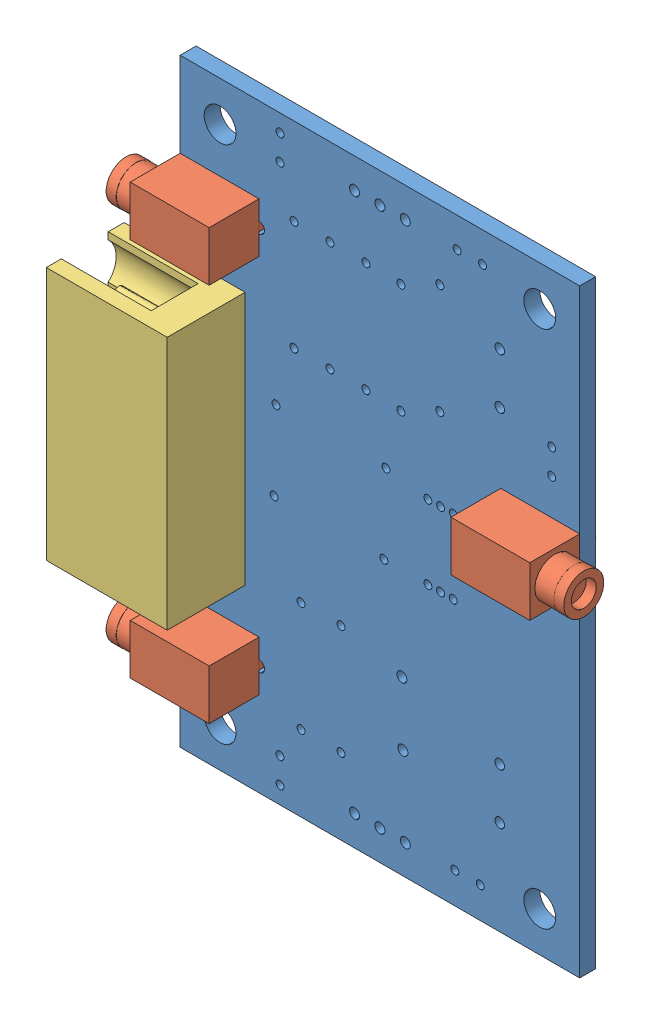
SolidWorks assembly Carte IR-GATE_B.SLDASM, configuration Défaut (file format 8000). Lengths in mm.
Overall size (48.51 60.01 10.81).
5 component instances, 3 part files, 11 mates.
Components (placement in the parent):
- PCB IR_GATE-1: PCB IR_GATE.SLDPRT [Défaut] at (-22.3945 -29.6859 59.1999) size (40.01 60.01 1.6)
- Embase jack 2.5-1: Embase jack 2.5.SLDPRT [Défaut] at (-22.3938 -18.6834 60.7999) x (1 0 0) z (0 -1 0) size (10.81 8.01 5)
- Embase jack 2.5-2: Embase jack 2.5.SLDPRT [Défaut] at (-22.3938 19.3238 60.7999) x (1 0 0) z (0 -1 0) size (10.81 8.01 5)
- V-TENM05 Connecteur male-1: V-TENM05 Connecteur male.SLDPRT [Défaut] at (-27.9925 13.0198 60.7999) x (0 -1 0) z (0 0 1) size (25.4 12.1 9.4)
- Embase jack 2.5-3: Embase jack 2.5.SLDPRT [Défaut] at (17.6119 6.3194 60.7999) x (-1 0 0) z (0 1 0) size (10.81 8.01 5)
Mates (geometry in assembly coordinates):
- Coïncidente1: coincident anti-aligned: axis of PCB IR_GATE-1 through (-18.8938 -18.6834 60.7999) axis (0 0 -1); axis of Embase jack 2.5-1 through (-18.8938 -18.6834 58.7999) axis (0 0 1)
- Coïncidente2: coincident anti-aligned: plane of PCB IR_GATE-1 through (-22.3945 -29.6859 60.7999) normal (0 0 1); plane of Embase jack 2.5-1 through (-22.3938 -21.1834 60.7999) normal (0 0 -1)
- Coïncidente4: coincident aligned: plane of PCB IR_GATE-1 through (-22.3945 -29.6859 60.7999) normal (-1 0 0); plane of Embase jack 2.5-1 through (-22.3938 -16.1834 65.7999) normal (-1 0 0)
- Coïncidente5: coincident anti-aligned: axis of PCB IR_GATE-1 through (-18.8938 19.3238 60.7999) axis (0 0 -1); axis of Embase jack 2.5-2 through (-18.8938 19.3238 58.7999) axis (0 0 1)
- Coïncidente6: coincident anti-aligned: plane of PCB IR_GATE-1 through (-22.3945 -29.6859 60.7999) normal (0 0 1); plane of Embase jack 2.5-2 through (-22.3938 16.8238 60.7999) normal (0 0 -1)
- Coïncidente7: coincident aligned: plane of PCB IR_GATE-1 through (-22.3945 -29.6859 60.7999) normal (-1 0 0); plane of Embase jack 2.5-2 through (-22.3938 21.8238 65.7999) normal (-1 0 0)
- Coïncidente66: coincident anti-aligned: axis of PCB IR_GATE-1 through (-17.3925 10.4806 60.7999) axis (0 0 -1); axis of V-TENM05 Connecteur male-1 through (-17.3925 10.4798 59.1999) axis (0 0 1)
- Coïncidente67: coincident anti-aligned: axis of PCB IR_GATE-1 through (-17.3925 5.3998 60.7999) axis (0 0 -1); axis of V-TENM05 Connecteur male-1 through (-17.3925 5.3998 59.1999) axis (0 0 1)
- Coïncidente68: coincident anti-aligned: plane of PCB IR_GATE-1 through (-22.3945 -29.6859 60.7999) normal (0 0 1); plane of V-TENM05 Connecteur male-1 through (-27.9925 13.0198 60.7999) normal (0 0 -1)
- Coïncidente69: coincident: axis of PCB IR_GATE-1 through (14.1112 6.3194 60.7999) axis (0 0 -1); axis of Embase jack 2.5-3 through (14.1119 6.3194 58.7999) axis (0 0 1)
- Coïncidente70: coincident aligned: line of PCB IR_GATE-1 through (17.6119 -29.6859 60.7999) axis (0 1 0); line of Embase jack 2.5-3 through (17.6119 3.8194 60.7999) axis (0 1 0)
